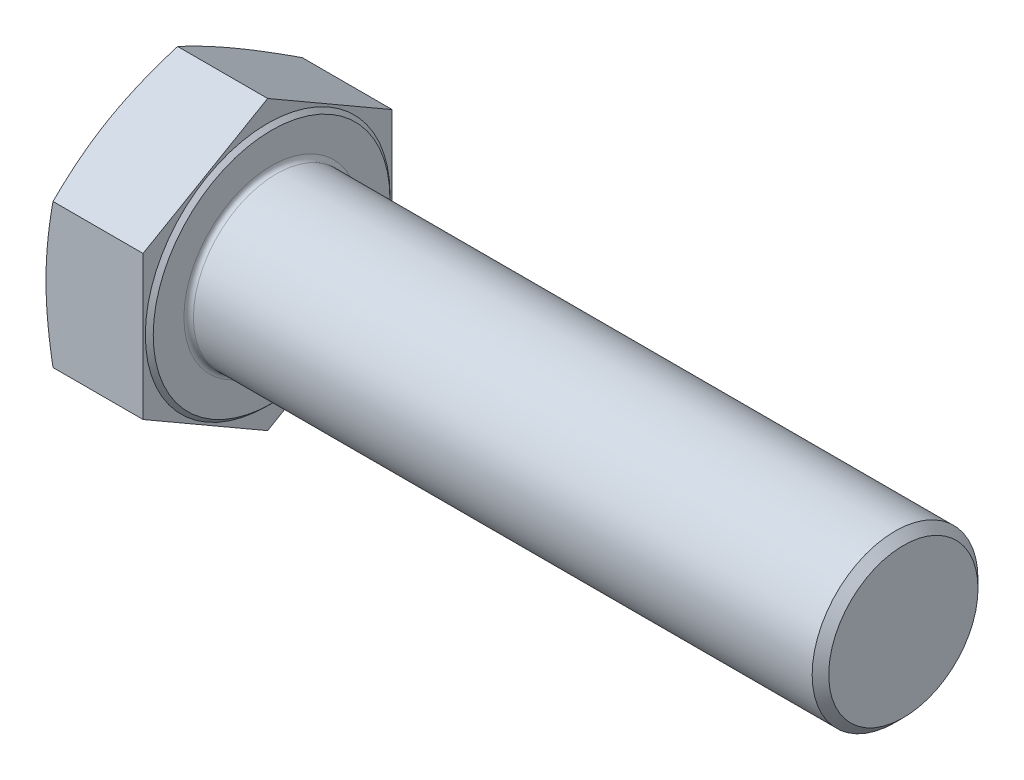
from build123d import *

# Parameters (mm, degrees)
BASEHEAD_DEPTH = 25.58
SKETCH5_R      = 21
BASEBODY_DEPTH = 160
CHAMFER1_SIZE  = 2.1
HEADFILLET_R   = 1.2


with BuildPart() as part:
    # Sketch2 → BaseHead (new body)
    with BuildSketch(Plane(origin=(0, 0, 0), x_dir=(0, 0, -1), z_dir=(1, 0, 0))):
        Polygon((0, -36.430801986), (31.55, -18.215400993), (31.55, 18.215400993), (0, 36.430801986), (-31.55, 18.215400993), (-31.55, -18.215400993), align=None)
    extrude(amount=BASEHEAD_DEPTH)

    # Sketch3 → BearingFace (revolve, cut)
    with BuildSketch(Plane.XY, mode=Mode.PRIVATE) as bearingface_sk:
        Polygon((25.58, 36.430801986), (25.58, 29.975), (24.58, 30.975), (24.58, 36.430801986), align=None)
    revolve(bearingface_sk.sketch.rotate(Axis((-0.957090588, 0, 0), (1, 0, 0)), 90), axis=Axis((-0.957090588, 0, 0), (1, 0, 0)), mode=Mode.SUBTRACT)

    # Sketch4 → HeadChamfer (revolve, cut)
    with BuildSketch(Plane.XY):
        Polygon((0, 36.430801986), (1.776466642, 36.430801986), (0, 31.55), align=None)
    revolve(axis=Axis((-0.493528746, 0, 0), (1, 0, 0)), mode=Mode.SUBTRACT)

    # Sketch5 → BaseBody (add)
    with BuildSketch(Plane(origin=(25.58, 0, 0), x_dir=(0, 0, -1), z_dir=(1, 0, 0))):
        with Locations(Location((0, 0, 0), (0, 0, 180))):
            Circle(SKETCH5_R)
    extrude(amount=BASEBODY_DEPTH)

    # Chamfer1
    chamfer1_edges = [part.edges().sort_by_distance(p)[0] for p in [
        (185.58, 0, -21),
    ]]
    chamfer(chamfer1_edges, length=CHAMFER1_SIZE)

    # HeadFillet
    headfillet_edges = [part.edges().sort_by_distance(p)[0] for p in [
        (25.58, 0, -21),
    ]]
    fillet(headfillet_edges, radius=HEADFILLET_R)


solid = part.part
